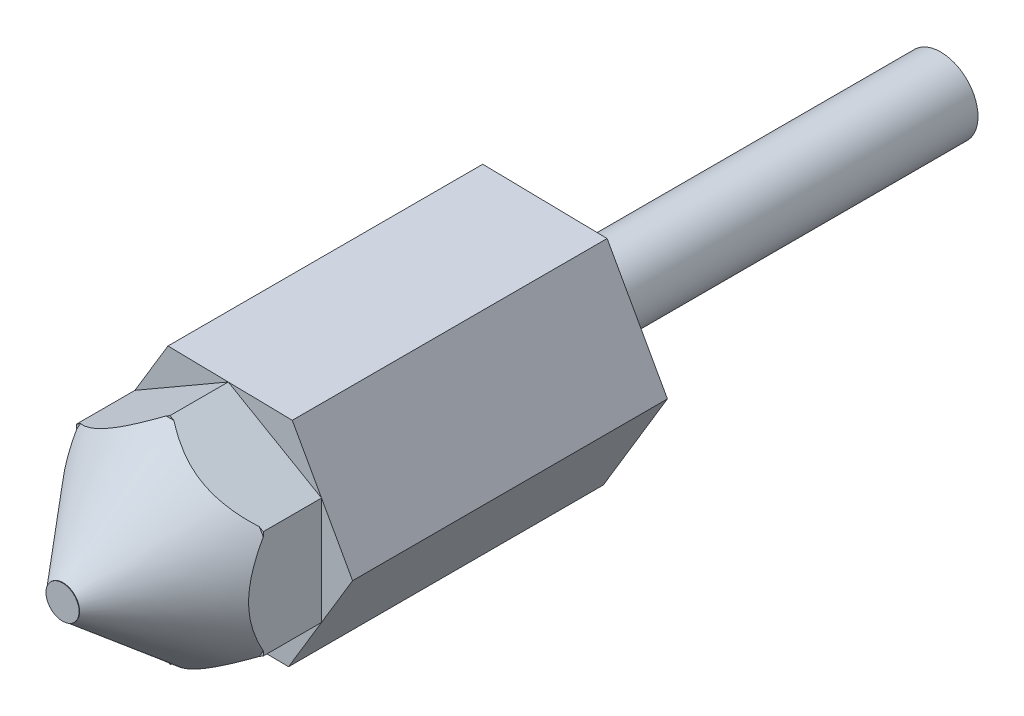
ISO-10303-21;
HEADER;
FILE_DESCRIPTION(('STEP AP214'),'2;1');
FILE_NAME('part.step','',(''),(''),'','','');
FILE_SCHEMA(('AUTOMOTIVE_DESIGN { 1 0 10303 214 1 1 1 1 }'));
ENDSEC;
DATA;
#1=APPLICATION_CONTEXT('core data for automotive mechanical design processes');
#2=APPLICATION_PROTOCOL_DEFINITION('international standard','automotive_design',2000,#1);
#3=PRODUCT_CONTEXT('',#1,'mechanical');
#4=PRODUCT('Part','Part','',(#3));
#5=PRODUCT_RELATED_PRODUCT_CATEGORY('part','',(#4));
#6=PRODUCT_DEFINITION_FORMATION('','',#4);
#7=PRODUCT_DEFINITION_CONTEXT('part definition',#1,'design');
#8=PRODUCT_DEFINITION('design','',#6,#7);
#9=PRODUCT_DEFINITION_SHAPE('','',#8);
#10=(LENGTH_UNIT() NAMED_UNIT(*) SI_UNIT(.MILLI.,.METRE.));
#11=(NAMED_UNIT(*) PLANE_ANGLE_UNIT() SI_UNIT($,.RADIAN.));
#12=(NAMED_UNIT(*) SI_UNIT($,.STERADIAN.) SOLID_ANGLE_UNIT());
#13=UNCERTAINTY_MEASURE_WITH_UNIT(LENGTH_MEASURE(1.E-05),#10,'distance_accuracy_value','');
#14=(GEOMETRIC_REPRESENTATION_CONTEXT(3) GLOBAL_UNCERTAINTY_ASSIGNED_CONTEXT((#13)) GLOBAL_UNIT_ASSIGNED_CONTEXT((#10,
#11,#12)) REPRESENTATION_CONTEXT('',''));
#15=CARTESIAN_POINT('',(0.,0.,0.));
#16=DIRECTION('',(0.,0.,1.));
#17=DIRECTION('',(1.,0.,0.));
#18=AXIS2_PLACEMENT_3D('',#15,#16,#17);
#19=CARTESIAN_POINT('',(5.63003281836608,3.25050096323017,10.));
#20=DIRECTION('',(-0.499999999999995,-0.866025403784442,0.));
#21=DIRECTION('',(0.866025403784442,-0.499999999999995,0.));
#22=AXIS2_PLACEMENT_3D('',#19,#20,#21);
#23=PLANE('',#22);
#24=DIRECTION('',(0.,0.,-1.));
#25=VECTOR('',#24,1.);
#26=CARTESIAN_POINT('',(0.,6.50100192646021,10.));
#27=LINE('',#26,#25);
#28=CARTESIAN_POINT('',(0.,6.50100192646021,3.5157355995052));
#29=VERTEX_POINT('',#28);
#30=CARTESIAN_POINT('',(0.,6.50100192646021,0.));
#31=VERTEX_POINT('',#30);
#32=EDGE_CURVE('E142',#29,#31,#27,.T.);
#33=ORIENTED_EDGE('',*,*,#32,.F.);
#34=DIRECTION('',(0.866025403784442,-0.499999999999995,0.));
#35=VECTOR('',#34,1.);
#36=CARTESIAN_POINT('',(5.63003281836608,3.25050096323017,3.5157355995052));
#37=LINE('',#36,#35);
#38=CARTESIAN_POINT('',(0.238864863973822,6.36309323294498,3.5157355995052));
#39=VERTEX_POINT('',#38);
#40=EDGE_CURVE('E255',#29,#39,#37,.T.);
#41=ORIENTED_EDGE('',*,*,#40,.T.);
#42=CARTESIAN_POINT('',(0.238556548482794,6.36327123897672,3.5155355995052));
#43=CARTESIAN_POINT('',(0.31511371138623,6.31907094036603,3.56519320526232));
#44=CARTESIAN_POINT('',(0.392304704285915,6.27450469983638,3.61354426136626));
#45=CARTESIAN_POINT('',(0.548064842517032,6.18457654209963,3.70728136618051));
#46=CARTESIAN_POINT('',(0.626634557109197,6.13921429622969,3.75266615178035));
#47=CARTESIAN_POINT('',(0.865216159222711,6.00146914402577,3.88418714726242));
#48=CARTESIAN_POINT('',(1.02739055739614,5.90783771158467,3.96522145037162));
#49=CARTESIAN_POINT('',(1.35585773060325,5.7181971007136,4.10922568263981));
#50=CARTESIAN_POINT('',(1.52209278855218,5.62222124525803,4.17236885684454));
#51=CARTESIAN_POINT('',(1.85927616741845,5.42754833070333,4.27752648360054));
#52=CARTESIAN_POINT('',(2.03021391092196,5.32885737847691,4.31958482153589));
#53=CARTESIAN_POINT('',(2.32313774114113,5.15973772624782,4.37027561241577));
#54=CARTESIAN_POINT('',(2.44432282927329,5.08977148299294,4.38516593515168));
#55=CARTESIAN_POINT('',(2.68740231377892,4.94942947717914,4.40238482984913));
#56=CARTESIAN_POINT('',(2.80929683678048,4.87905364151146,4.40471108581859));
#57=CARTESIAN_POINT('',(3.0528092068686,4.73846170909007,4.39666763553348));
#58=CARTESIAN_POINT('',(3.17442693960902,4.66824567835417,4.38629339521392));
#59=CARTESIAN_POINT('',(3.4163820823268,4.52855281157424,4.35335337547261));
#60=CARTESIAN_POINT('',(3.53671963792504,4.45907589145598,4.33078899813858));
#61=CARTESIAN_POINT('',(3.80861163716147,4.30209897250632,4.26661042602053));
#62=CARTESIAN_POINT('',(3.95953591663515,4.21496279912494,4.22144273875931));
#63=CARTESIAN_POINT('',(4.25724444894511,4.04308069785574,4.11546730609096));
#64=CARTESIAN_POINT('',(4.40402592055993,3.95833637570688,4.05464931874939));
#65=CARTESIAN_POINT('',(4.62112830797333,3.83299225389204,3.95366431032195));
#66=CARTESIAN_POINT('',(4.69315832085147,3.79140570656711,3.91827666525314));
#67=CARTESIAN_POINT('',(4.83605956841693,3.70890163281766,3.84460653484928));
#68=CARTESIAN_POINT('',(4.90693136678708,3.66798378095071,3.80632551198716));
#69=CARTESIAN_POINT('',(5.04734003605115,3.58691879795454,3.72729034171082));
#70=CARTESIAN_POINT('',(5.11688052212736,3.54676957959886,3.68654471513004));
#71=CARTESIAN_POINT('',(5.25492564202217,3.46706919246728,3.60272105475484));
#72=CARTESIAN_POINT('',(5.32342997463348,3.42751819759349,3.55964235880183));
#73=CARTESIAN_POINT('',(5.39142704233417,3.38826007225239,3.51553559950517));
#74=B_SPLINE_CURVE_WITH_KNOTS('',3,(#42,#43,#44,#45,#46,#47,#48,#49,#50,#51,#52,#53,#54,#55,#56,
#57,#58,#59,#60,#61,#62,#63,#64,#65,#66,#67,#68,#69,#70,#71,#72,#73),.UNSPECIFIED.,.F.,.F.,(4,2,
2,2,2,2,2,2,2,2,2,2,2,2,2,4),(0.,0.30415764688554,0.608443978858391,1.21984322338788,
1.82510226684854,2.42909625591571,2.85074868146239,3.27247882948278,3.69435957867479,
4.11619181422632,4.6553913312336,5.19494461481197,5.46606472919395,5.73704870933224,
6.00714414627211,6.27731664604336),.UNSPECIFIED.);
#75=CARTESIAN_POINT('',(5.39111872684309,3.38843807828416,3.5157355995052));
#76=VERTEX_POINT('',#75);
#77=EDGE_CURVE('E275',#39,#76,#74,.T.);
#78=ORIENTED_EDGE('',*,*,#77,.T.);
#79=CARTESIAN_POINT('',(5.63003281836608,3.25050096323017,3.5157355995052));
#80=VERTEX_POINT('',#79);
#81=EDGE_CURVE('E145',#76,#80,#37,.T.);
#82=ORIENTED_EDGE('',*,*,#81,.T.);
#83=DIRECTION('',(0.,0.,-1.));
#84=VECTOR('',#83,1.);
#85=CARTESIAN_POINT('',(5.63003281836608,3.25050096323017,10.));
#86=LINE('',#85,#84);
#87=CARTESIAN_POINT('',(5.63003281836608,3.25050096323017,0.));
#88=VERTEX_POINT('',#87);
#89=EDGE_CURVE('E67',#80,#88,#86,.T.);
#90=ORIENTED_EDGE('',*,*,#89,.T.);
#91=DIRECTION('',(-0.866025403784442,0.499999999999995,0.));
#92=VECTOR('',#91,1.);
#93=CARTESIAN_POINT('',(5.63003281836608,3.25050096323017,0.));
#94=LINE('',#93,#92);
#95=EDGE_CURVE('E253',#88,#31,#94,.T.);
#96=ORIENTED_EDGE('',*,*,#95,.T.);
#97=EDGE_LOOP('',(#33,#41,#78,#82,#90,#96));
#98=FACE_BOUND('',#97,.T.);
#99=ADVANCED_FACE('F44',(#98),#23,.F.);
#100=CARTESIAN_POINT('',(0.,6.50100192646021,10.));
#101=DIRECTION('',(0.500000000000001,-0.866025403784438,0.));
#102=DIRECTION('',(0.866025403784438,0.500000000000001,0.));
#103=AXIS2_PLACEMENT_3D('',#100,#101,#102);
#104=PLANE('',#103);
#105=DIRECTION('',(0.,0.,-1.));
#106=VECTOR('',#105,1.);
#107=CARTESIAN_POINT('',(-5.63003281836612,3.25050096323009,10.));
#108=LINE('',#107,#106);
#109=CARTESIAN_POINT('',(-5.63003281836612,3.25050096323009,3.5157355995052));
#110=VERTEX_POINT('',#109);
#111=CARTESIAN_POINT('',(-5.63003281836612,3.25050096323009,0.));
#112=VERTEX_POINT('',#111);
#113=EDGE_CURVE('E164',#110,#112,#108,.T.);
#114=ORIENTED_EDGE('',*,*,#113,.F.);
#115=DIRECTION('',(0.866025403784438,0.500000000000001,0.));
#116=VECTOR('',#115,1.);
#117=CARTESIAN_POINT('',(0.,6.50100192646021,3.5157355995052));
#118=LINE('',#117,#116);
#119=CARTESIAN_POINT('',(-5.39117023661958,3.38840833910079,3.5157355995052));
#120=VERTEX_POINT('',#119);
#121=EDGE_CURVE('E230',#110,#120,#118,.T.);
#122=ORIENTED_EDGE('',*,*,#121,.T.);
#123=CARTESIAN_POINT('',(-5.39147854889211,3.38823033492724,3.51553559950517));
#124=CARTESIAN_POINT('',(-5.31492075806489,3.4324309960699,3.56519413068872));
#125=CARTESIAN_POINT('',(-5.23772912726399,3.47699760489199,3.61354610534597));
#126=CARTESIAN_POINT('',(-5.08196768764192,3.56692651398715,3.70728502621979));
#127=CARTESIAN_POINT('',(-5.00339730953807,3.61228914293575,3.75267070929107));
#128=CARTESIAN_POINT('',(-4.76481363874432,3.75003548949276,3.88419437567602));
#129=CARTESIAN_POINT('',(-4.60263778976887,3.8436677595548,3.96523040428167));
#130=CARTESIAN_POINT('',(-4.27416761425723,4.03331010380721,4.10923781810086));
#131=CARTESIAN_POINT('',(-4.10793100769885,4.12928685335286,4.17238245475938));
#132=CARTESIAN_POINT('',(-3.77074438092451,4.32396164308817,4.27754262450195));
#133=CARTESIAN_POINT('',(-3.59980493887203,4.42265357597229,4.31960204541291));
#134=CARTESIAN_POINT('',(-3.30687967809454,4.59177405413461,4.37029395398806));
#135=CARTESIAN_POINT('',(-3.18569490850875,4.66174011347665,4.38518460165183));
#136=CARTESIAN_POINT('',(-2.94261603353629,4.80208176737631,4.40240418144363));
#137=CARTESIAN_POINT('',(-2.82072180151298,4.87245743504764,4.40473079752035));
#138=CARTESIAN_POINT('',(-2.57720998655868,5.01304904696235,4.39668808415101));
#139=CARTESIAN_POINT('',(-2.45559251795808,5.08326492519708,4.38631422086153));
#140=CARTESIAN_POINT('',(-2.213637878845,5.22295750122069,4.35337495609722));
#141=CARTESIAN_POINT('',(-2.09330056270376,5.29243428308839,4.33081095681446));
#142=CARTESIAN_POINT('',(-1.82140518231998,5.44941315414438,4.26663230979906));
#143=CARTESIAN_POINT('',(-1.67047735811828,5.53655137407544,4.22146369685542));
#144=CARTESIAN_POINT('',(-1.3727619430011,5.70843744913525,4.11548565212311));
#145=CARTESIAN_POINT('',(-1.22597713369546,5.7931836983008,4.05466597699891));
#146=CARTESIAN_POINT('',(-1.00886985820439,5.9185306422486,3.9536780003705));
#147=CARTESIAN_POINT('',(-0.936838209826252,5.96011813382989,3.91828927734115));
#148=CARTESIAN_POINT('',(-0.793933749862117,6.04262406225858,3.84461687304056));
#149=CARTESIAN_POINT('',(-0.723060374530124,6.08354282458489,3.80633465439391));
#150=CARTESIAN_POINT('',(-0.582648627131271,6.164609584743,3.72729700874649));
#151=CARTESIAN_POINT('',(-0.513106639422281,6.20475967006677,3.68655010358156));
#152=CARTESIAN_POINT('',(-0.37505856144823,6.2844617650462,3.60272380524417));
#153=CARTESIAN_POINT('',(-0.306552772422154,6.32401360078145,3.55964374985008));
#154=CARTESIAN_POINT('',(-0.238554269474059,6.36327255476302,3.5155355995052));
#155=B_SPLINE_CURVE_WITH_KNOTS('',3,(#123,#124,#125,#126,#127,#128,#129,#130,#131,#132,#133,
#134,#135,#136,#137,#138,#139,#140,#141,#142,#143,#144,#145,#146,#147,#148,#149,#150,#151,#152,
#153,#154),.UNSPECIFIED.,.F.,.F.,(4,2,2,2,2,2,2,2,2,2,2,2,2,2,2,4),(0.,0.304160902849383,
0.608450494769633,1.21985639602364,1.82512188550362,2.42912225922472,2.8507736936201,
3.27250285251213,3.69438260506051,4.11621384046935,4.65542586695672,5.19499169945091,
5.46611829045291,5.73710873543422,6.00721054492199,6.27738942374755),.UNSPECIFIED.);
#156=CARTESIAN_POINT('',(-0.238862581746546,6.36309455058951,3.5157355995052));
#157=VERTEX_POINT('',#156);
#158=EDGE_CURVE('E210',#120,#157,#155,.T.);
#159=ORIENTED_EDGE('',*,*,#158,.T.);
#160=EDGE_CURVE('E246',#157,#29,#118,.T.);
#161=ORIENTED_EDGE('',*,*,#160,.T.);
#162=ORIENTED_EDGE('',*,*,#32,.T.);
#163=DIRECTION('',(-0.866025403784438,-0.500000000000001,0.));
#164=VECTOR('',#163,1.);
#165=CARTESIAN_POINT('',(0.,6.50100192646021,0.));
#166=LINE('',#165,#164);
#167=EDGE_CURVE('E232',#31,#112,#166,.T.);
#168=ORIENTED_EDGE('',*,*,#167,.T.);
#169=EDGE_LOOP('',(#114,#122,#159,#161,#162,#168));
#170=FACE_BOUND('',#169,.T.);
#171=ADVANCED_FACE('F218',(#170),#104,.F.);
#172=CARTESIAN_POINT('',(-5.63003281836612,3.25050096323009,10.));
#173=DIRECTION('',(1.,0.,0.));
#174=DIRECTION('',(0.,1.,0.));
#175=AXIS2_PLACEMENT_3D('',#172,#173,#174);
#176=PLANE('',#175);
#177=DIRECTION('',(0.,0.,-1.));
#178=VECTOR('',#177,1.);
#179=CARTESIAN_POINT('',(-5.6300328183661,-3.25050096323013,10.));
#180=LINE('',#179,#178);
#181=CARTESIAN_POINT('',(-5.6300328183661,-3.25050096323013,3.5157355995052));
#182=VERTEX_POINT('',#181);
#183=CARTESIAN_POINT('',(-5.6300328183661,-3.25050096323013,0.));
#184=VERTEX_POINT('',#183);
#185=EDGE_CURVE('E162',#182,#184,#180,.T.);
#186=ORIENTED_EDGE('',*,*,#185,.F.);
#187=DIRECTION('',(0.,1.,0.));
#188=VECTOR('',#187,1.);
#189=CARTESIAN_POINT('',(-5.63003281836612,3.25050096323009,3.5157355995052));
#190=LINE('',#189,#188);
#191=CARTESIAN_POINT('',(-5.6300328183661,-2.97462673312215,3.5157355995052));
#192=VERTEX_POINT('',#191);
#193=EDGE_CURVE('E244',#182,#192,#190,.T.);
#194=ORIENTED_EDGE('',*,*,#193,.T.);
#195=CARTESIAN_POINT('',(-5.63003281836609,-5.87576129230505,1.38716200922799));
#196=CARTESIAN_POINT('',(-5.63003281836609,-5.74069500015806,1.50440823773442));
#197=CARTESIAN_POINT('',(-5.63003281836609,-5.60468641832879,1.62058619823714));
#198=CARTESIAN_POINT('',(-5.63003281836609,-5.33043886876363,1.85035197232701));
#199=CARTESIAN_POINT('',(-5.63003281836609,-5.19219931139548,1.9639390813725));
#200=CARTESIAN_POINT('',(-5.63003281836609,-4.91207787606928,2.18892030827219));
#201=CARTESIAN_POINT('',(-5.63003281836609,-4.77017548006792,2.3002889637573));
#202=CARTESIAN_POINT('',(-5.63003281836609,-4.48345521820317,2.51919574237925));
#203=CARTESIAN_POINT('',(-5.63003281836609,-4.33863757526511,2.62673415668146));
#204=CARTESIAN_POINT('',(-5.6300328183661,-4.03747668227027,2.84301748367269));
#205=CARTESIAN_POINT('',(-5.6300328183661,-3.88094090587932,2.95149559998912));
#206=CARTESIAN_POINT('',(-5.6300328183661,-3.56352703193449,3.16199968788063));
#207=CARTESIAN_POINT('',(-5.6300328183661,-3.40264822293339,3.26402459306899));
#208=CARTESIAN_POINT('',(-5.6300328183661,-3.07650861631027,3.4596092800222));
#209=CARTESIAN_POINT('',(-5.6300328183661,-2.91126392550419,3.55319573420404));
#210=CARTESIAN_POINT('',(-5.6300328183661,-2.57540191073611,3.73010310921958));
#211=CARTESIAN_POINT('',(-5.6300328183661,-2.40478711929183,3.81342878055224));
#212=CARTESIAN_POINT('',(-5.6300328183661,-2.08741309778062,3.95403770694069));
#213=CARTESIAN_POINT('',(-5.6300328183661,-1.94155307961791,4.01333842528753));
#214=CARTESIAN_POINT('',(-5.6300328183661,-1.64586823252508,4.12127253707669));
#215=CARTESIAN_POINT('',(-5.6300328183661,-1.49604284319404,4.16990441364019));
#216=CARTESIAN_POINT('',(-5.63003281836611,-1.1947947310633,4.25404036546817));
#217=CARTESIAN_POINT('',(-5.63003281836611,-1.04341773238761,4.28970610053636));
#218=CARTESIAN_POINT('',(-5.63003281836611,-0.738051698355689,4.34708465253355));
#219=CARTESIAN_POINT('',(-5.63003281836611,-0.584063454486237,4.36880162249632));
#220=CARTESIAN_POINT('',(-5.63003281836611,-0.266815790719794,4.39780694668));
#221=CARTESIAN_POINT('',(-5.63003281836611,-0.103482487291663,4.40430705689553));
#222=CARTESIAN_POINT('',(-5.63003281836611,0.222957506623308,4.40014572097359));
#223=CARTESIAN_POINT('',(-5.63003281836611,0.386064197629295,4.38948431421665));
#224=CARTESIAN_POINT('',(-5.63003281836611,0.711024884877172,4.35162039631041));
#225=CARTESIAN_POINT('',(-5.63003281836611,0.87287048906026,4.32434701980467));
#226=CARTESIAN_POINT('',(-5.63003281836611,1.19329360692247,4.25481624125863));
#227=CARTESIAN_POINT('',(-5.63003281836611,1.35187023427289,4.21255483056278));
#228=CARTESIAN_POINT('',(-5.63003281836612,1.71388431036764,4.09990044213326));
#229=CARTESIAN_POINT('',(-5.63003281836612,1.91586180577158,4.02484366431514));
#230=CARTESIAN_POINT('',(-5.63003281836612,2.3123730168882,3.85724745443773));
#231=CARTESIAN_POINT('',(-5.63003281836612,2.50690300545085,3.76469940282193));
#232=CARTESIAN_POINT('',(-5.63003281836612,2.8909443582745,3.56513557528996));
#233=CARTESIAN_POINT('',(-5.63003281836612,3.08038073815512,3.45797693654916));
#234=CARTESIAN_POINT('',(-5.63003281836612,3.35969529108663,3.28941248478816));
#235=CARTESIAN_POINT('',(-5.63003281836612,3.45198181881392,3.23192788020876));
#236=CARTESIAN_POINT('',(-5.63003281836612,3.63507478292,3.11465132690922));
#237=CARTESIAN_POINT('',(-5.63003281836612,3.72588126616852,3.05485945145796));
#238=CARTESIAN_POINT('',(-5.63003281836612,4.00626211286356,2.86570187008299));
#239=CARTESIAN_POINT('',(-5.63003281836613,4.19348262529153,2.73284238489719));
#240=CARTESIAN_POINT('',(-5.63003281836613,4.56282961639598,2.46019614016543));
#241=CARTESIAN_POINT('',(-5.63003281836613,4.74495491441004,2.32040779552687));
#242=CARTESIAN_POINT('',(-5.63003281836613,5.10506237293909,2.03530270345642));
#243=CARTESIAN_POINT('',(-5.63003281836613,5.28304089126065,1.8899813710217));
#244=CARTESIAN_POINT('',(-5.63003281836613,5.63537081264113,1.59504829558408));
#245=CARTESIAN_POINT('',(-5.63003281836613,5.80972248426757,1.44543687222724));
#246=CARTESIAN_POINT('',(-5.63003281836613,6.15605195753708,1.14215814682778));
#247=CARTESIAN_POINT('',(-5.63003281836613,6.32801792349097,0.988477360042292));
#248=CARTESIAN_POINT('',(-5.63003281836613,6.66934990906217,0.678251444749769));
#249=CARTESIAN_POINT('',(-5.63003281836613,6.83871584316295,0.52170622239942));
#250=CARTESIAN_POINT('',(-5.63003281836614,7.34353472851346,0.0485165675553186));
#251=CARTESIAN_POINT('',(-5.63003281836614,7.67568162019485,-0.271657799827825));
#252=CARTESIAN_POINT('',(-5.63003281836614,8.15258137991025,-0.740739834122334));
#253=CARTESIAN_POINT('',(-5.63003281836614,8.29994959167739,-0.887014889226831));
#254=CARTESIAN_POINT('',(-5.63003281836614,8.59349852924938,-1.18073468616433));
#255=CARTESIAN_POINT('',(-5.63003281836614,8.73967933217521,-1.32817935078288));
#256=CARTESIAN_POINT('',(-5.63003281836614,9.17671009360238,-1.77208961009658));
#257=CARTESIAN_POINT('',(-5.63003281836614,9.46600369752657,-2.07008731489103));
#258=CARTESIAN_POINT('',(-5.63003281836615,10.0387509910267,-2.66656675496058));
#259=CARTESIAN_POINT('',(-5.63003281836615,10.3222337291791,-2.96502067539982));
#260=CARTESIAN_POINT('',(-5.63003281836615,10.8865053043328,-3.56435498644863));
#261=CARTESIAN_POINT('',(-5.63003281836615,11.1672946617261,-3.8652348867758));
#262=CARTESIAN_POINT('',(-5.63003281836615,11.4470594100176,-4.16705530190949));
#263=B_SPLINE_CURVE_WITH_KNOTS('',3,(#195,#196,#197,#198,#199,#200,#201,#202,#203,#204,#205,
#206,#207,#208,#209,#210,#211,#212,#213,#214,#215,#216,#217,#218,#219,#220,#221,#222,#223,#224,
#225,#226,#227,#228,#229,#230,#231,#232,#233,#234,#235,#236,#237,#238,#239,#240,#241,#242,#243,
#244,#245,#246,#247,#248,#249,#250,#251,#252,#253,#254,#255,#256,#257,#258,#259,#260,#261,#262),
.UNSPECIFIED.,.F.,.F.,(4,2,2,2,2,2,2,2,2,2,2,2,2,2,2,2,2,2,2,2,2,2,2,2,2,2,2,2,2,2,2,2,2,4),(0.,
0.53658006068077,1.07330433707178,1.6144088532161,2.15547214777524,2.72669081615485,
3.29800363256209,3.86744221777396,4.43661616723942,4.90863379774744,5.38071849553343,
5.84669723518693,6.31253717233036,6.80202012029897,7.2915019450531,7.78308662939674,
8.2748028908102,8.92011666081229,9.56574926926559,10.2182206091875,10.5443717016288,
10.8705124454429,11.5589975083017,12.2476408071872,12.9368677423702,13.6260434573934,
14.3178932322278,15.0097657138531,16.3936194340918,17.0165330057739,17.6394057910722,
18.8853398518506,20.1202060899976,21.3548287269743),.UNSPECIFIED.);
#264=CARTESIAN_POINT('',(-5.63003281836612,2.97468357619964,3.5157355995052));
#265=VERTEX_POINT('',#264);
#266=EDGE_CURVE('E204',#192,#265,#263,.T.);
#267=ORIENTED_EDGE('',*,*,#266,.T.);
#268=EDGE_CURVE('E239',#265,#110,#190,.T.);
#269=ORIENTED_EDGE('',*,*,#268,.T.);
#270=ORIENTED_EDGE('',*,*,#113,.T.);
#271=DIRECTION('',(0.,-1.,0.));
#272=VECTOR('',#271,1.);
#273=CARTESIAN_POINT('',(-5.63003281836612,3.25050096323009,0.));
#274=LINE('',#273,#272);
#275=EDGE_CURVE('E237',#112,#184,#274,.T.);
#276=ORIENTED_EDGE('',*,*,#275,.T.);
#277=EDGE_LOOP('',(#186,#194,#267,#269,#270,#276));
#278=FACE_BOUND('',#277,.T.);
#279=ADVANCED_FACE('F215',(#278),#176,.F.);
#280=CARTESIAN_POINT('',(-5.6300328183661,-3.25050096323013,10.));
#281=DIRECTION('',(0.499999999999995,0.866025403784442,0.));
#282=DIRECTION('',(-0.866025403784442,0.499999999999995,0.));
#283=AXIS2_PLACEMENT_3D('',#280,#281,#282);
#284=PLANE('',#283);
#285=DIRECTION('',(0.,0.,-1.));
#286=VECTOR('',#285,1.);
#287=CARTESIAN_POINT('',(0.,-6.50100192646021,10.));
#288=LINE('',#287,#286);
#289=CARTESIAN_POINT('',(0.,-6.50100192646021,3.5157355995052));
#290=VERTEX_POINT('',#289);
#291=CARTESIAN_POINT('',(0.,-6.50100192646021,0.));
#292=VERTEX_POINT('',#291);
#293=EDGE_CURVE('E155',#290,#292,#288,.T.);
#294=ORIENTED_EDGE('',*,*,#293,.F.);
#295=DIRECTION('',(-0.866025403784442,0.499999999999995,0.));
#296=VECTOR('',#295,1.);
#297=CARTESIAN_POINT('',(-5.6300328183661,-3.25050096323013,3.5157355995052));
#298=LINE('',#297,#296);
#299=CARTESIAN_POINT('',(-0.238967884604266,-6.36303375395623,3.5157355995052));
#300=VERTEX_POINT('',#299);
#301=EDGE_CURVE('E250',#290,#300,#298,.T.);
#302=ORIENTED_EDGE('',*,*,#301,.T.);
#303=CARTESIAN_POINT('',(-0.238659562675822,-6.36321176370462,3.5155355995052));
#304=CARTESIAN_POINT('',(-0.315215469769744,-6.31901219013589,3.56519135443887));
#305=CARTESIAN_POINT('',(-0.392405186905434,-6.27444668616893,3.61354057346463));
#306=CARTESIAN_POINT('',(-0.54816272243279,-6.18452003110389,3.70727404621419));
#307=CARTESIAN_POINT('',(-0.626731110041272,-6.13915855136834,3.75265703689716));
#308=CARTESIAN_POINT('',(-0.865308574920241,-6.00141578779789,3.8841726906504));
#309=CARTESIAN_POINT('',(-1.02748007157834,-5.90778603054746,3.96520354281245));
#310=CARTESIAN_POINT('',(-1.35594124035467,-5.7181488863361,4.10920141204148));
#311=CARTESIAN_POINT('',(-1.52217320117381,-5.62217481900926,4.17234166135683));
#312=CARTESIAN_POINT('',(-1.85935008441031,-5.42750565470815,4.27749420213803));
#313=CARTESIAN_POINT('',(-2.03028443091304,-5.32881666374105,4.31955037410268));
#314=CARTESIAN_POINT('',(-2.32320540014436,-5.15969866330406,4.37023892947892));
#315=CARTESIAN_POINT('',(-2.44439112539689,-5.08973205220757,4.38512860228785));
#316=CARTESIAN_POINT('',(-2.68747182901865,-4.94938934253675,4.40234612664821));
#317=CARTESIAN_POINT('',(-2.80936693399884,-4.87901317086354,4.40467166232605));
#318=CARTESIAN_POINT('',(-3.05288041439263,-4.73842059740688,4.39662673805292));
#319=CARTESIAN_POINT('',(-3.17449867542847,-4.66820426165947,4.3862517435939));
#320=CARTESIAN_POINT('',(-3.41645482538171,-4.52851081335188,4.35331021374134));
#321=CARTESIAN_POINT('',(-3.53679285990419,-4.45903361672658,4.33074508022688));
#322=CARTESIAN_POINT('',(-3.80867809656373,-4.30206060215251,4.26656665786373));
#323=CARTESIAN_POINT('',(-3.95959528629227,-4.2149285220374,4.22140082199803));
#324=CARTESIAN_POINT('',(-4.25729005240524,-4.04305436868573,4.11543061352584));
#325=CARTESIAN_POINT('',(-4.40406484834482,-3.95831390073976,4.05461600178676));
#326=CARTESIAN_POINT('',(-4.62115745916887,-3.83297542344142,3.9536369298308));
#327=CARTESIAN_POINT('',(-4.69318420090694,-3.7913907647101,3.91825144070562));
#328=CARTESIAN_POINT('',(-4.83607902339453,-3.70889040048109,3.84458585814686));
#329=CARTESIAN_POINT('',(-4.90694766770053,-3.66797436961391,3.80630722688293));
#330=CARTESIAN_POINT('',(-5.04735018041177,-3.58691294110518,3.72727700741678));
#331=CARTESIAN_POINT('',(-5.11688766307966,-3.5467654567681,3.68653393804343));
#332=CARTESIAN_POINT('',(-5.25492686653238,-3.46706848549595,3.6027155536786));
#333=CARTESIAN_POINT('',(-5.32342828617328,-3.42751917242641,3.55963957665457));
#334=CARTESIAN_POINT('',(-5.39142248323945,-3.38826270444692,3.51553559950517));
#335=B_SPLINE_CURVE_WITH_KNOTS('',3,(#303,#304,#305,#306,#307,#308,#309,#310,#311,#312,#313,
#314,#315,#316,#317,#318,#319,#320,#321,#322,#323,#324,#325,#326,#327,#328,#329,#330,#331,#332,
#333,#334),.UNSPECIFIED.,.F.,.F.,(4,2,2,2,2,2,2,2,2,2,2,2,2,2,2,4),(0.,0.304151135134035,
0.608430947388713,1.21981687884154,1.82506303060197,2.42904425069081,2.85069865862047,
3.27243078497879,3.69431352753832,4.1161477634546,4.65532226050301,5.19485044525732,
5.46595760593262,5.73692865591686,6.00701134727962,6.27717108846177),.UNSPECIFIED.);
#336=CARTESIAN_POINT('',(-5.39111416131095,-3.38844071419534,3.5157355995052));
#337=VERTEX_POINT('',#336);
#338=EDGE_CURVE('E197',#300,#337,#335,.T.);
#339=ORIENTED_EDGE('',*,*,#338,.T.);
#340=EDGE_CURVE('E248',#337,#182,#298,.T.);
#341=ORIENTED_EDGE('',*,*,#340,.T.);
#342=ORIENTED_EDGE('',*,*,#185,.T.);
#343=DIRECTION('',(0.866025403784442,-0.499999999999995,0.));
#344=VECTOR('',#343,1.);
#345=CARTESIAN_POINT('',(-5.6300328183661,-3.25050096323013,0.));
#346=LINE('',#345,#344);
#347=EDGE_CURVE('E258',#184,#292,#346,.T.);
#348=ORIENTED_EDGE('',*,*,#347,.T.);
#349=EDGE_LOOP('',(#294,#302,#339,#341,#342,#348));
#350=FACE_BOUND('',#349,.T.);
#351=ADVANCED_FACE('F187',(#350),#284,.F.);
#352=CARTESIAN_POINT('',(0.,-6.50100192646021,10.));
#353=DIRECTION('',(-0.500000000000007,0.866025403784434,0.));
#354=DIRECTION('',(-0.866025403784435,-0.500000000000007,0.));
#355=AXIS2_PLACEMENT_3D('',#352,#353,#354);
#356=PLANE('',#355);
#357=DIRECTION('',(0.,0.,-1.));
#358=VECTOR('',#357,1.);
#359=CARTESIAN_POINT('',(5.63003281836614,-3.25050096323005,10.));
#360=LINE('',#359,#358);
#361=CARTESIAN_POINT('',(5.63003281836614,-3.25050096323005,3.5157355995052));
#362=VERTEX_POINT('',#361);
#363=CARTESIAN_POINT('',(5.63003281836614,-3.25050096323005,0.));
#364=VERTEX_POINT('',#363);
#365=EDGE_CURVE('E153',#362,#364,#360,.T.);
#366=ORIENTED_EDGE('',*,*,#365,.F.);
#367=DIRECTION('',(-0.866025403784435,-0.500000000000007,0.));
#368=VECTOR('',#367,1.);
#369=CARTESIAN_POINT('',(0.,-6.50100192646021,3.5157355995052));
#370=LINE('',#369,#368);
#371=CARTESIAN_POINT('',(5.39106265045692,-3.38847045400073,3.5157355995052));
#372=VERTEX_POINT('',#371);
#373=EDGE_CURVE('E274',#362,#372,#370,.T.);
#374=ORIENTED_EDGE('',*,*,#373,.T.);
#375=CARTESIAN_POINT('',(5.39137097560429,-3.3882924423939,3.51553559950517));
#376=CARTESIAN_POINT('',(5.3148156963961,-3.43249165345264,3.56519042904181));
#377=CARTESIAN_POINT('',(5.23762661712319,-3.47705678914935,3.6135387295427));
#378=CARTESIAN_POINT('',(5.08187038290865,-3.56698269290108,3.70727038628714));
#379=CARTESIAN_POINT('',(5.00330265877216,-3.6123437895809,3.75265247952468));
#380=CARTESIAN_POINT('',(4.76472726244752,-3.75008535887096,3.88416546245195));
#381=CARTESIAN_POINT('',(4.60255721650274,-3.84371427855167,3.96519458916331));
#382=CARTESIAN_POINT('',(4.27409904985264,-4.03334968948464,4.10918927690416));
#383=CARTESIAN_POINT('',(4.10786863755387,-4.12932286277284,4.17232806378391));
#384=CARTESIAN_POINT('',(3.77069500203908,-4.32399015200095,4.27747806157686));
#385=CARTESIAN_POINT('',(3.59976235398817,-4.42267816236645,4.31953315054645));
#386=CARTESIAN_POINT('',(3.30684281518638,-4.59179533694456,4.3702205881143));
#387=CARTESIAN_POINT('',(3.18565677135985,-4.66176213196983,4.3851099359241));
#388=CARTESIAN_POINT('',(2.94257545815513,-4.80210519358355,4.40232677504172));
#389=CARTESIAN_POINT('',(2.82068006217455,-4.87248153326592,4.40465195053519));
#390=CARTESIAN_POINT('',(2.57716602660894,-5.01307442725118,4.39660628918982));
#391=CARTESIAN_POINT('',(2.45554750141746,-5.08329091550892,4.3862309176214));
#392=CARTESIAN_POINT('',(2.21359084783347,-5.22298465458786,4.35328863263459));
#393=CARTESIAN_POINT('',(2.09325257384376,-5.29246198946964,4.33072312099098));
#394=CARTESIAN_POINT('',(1.82137071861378,-5.44943305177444,4.26654477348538));
#395=CARTESIAN_POINT('',(1.67045707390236,-5.53656308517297,4.22137986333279));
#396=CARTESIAN_POINT('',(1.37276919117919,-5.70843326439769,4.11541226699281));
#397=CARTESIAN_POINT('',(1.22599773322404,-5.79317180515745,4.05459934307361));
#398=CARTESIAN_POINT('',(1.00891001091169,-5.91850746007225,3.95362323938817));
#399=CARTESIAN_POINT('',(0.936884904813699,-5.96009117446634,3.91823882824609));
#400=CARTESIAN_POINT('',(0.79399329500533,-6.04258968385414,3.8445755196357));
#401=CARTESIAN_POINT('',(0.723126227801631,-6.08350480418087,3.80629808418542));
#402=CARTESIAN_POINT('',(0.582726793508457,-6.16456445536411,3.72727034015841));
#403=CARTESIAN_POINT('',(0.5131908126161,-6.20471107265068,3.68652854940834));
#404=CARTESIAN_POINT('',(0.375154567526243,-6.28440633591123,3.60271280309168));
#405=CARTESIAN_POINT('',(0.306654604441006,-6.32395480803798,3.55963818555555));
#406=CARTESIAN_POINT('',(0.238661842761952,-6.36321044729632,3.5155355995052));
#407=B_SPLINE_CURVE_WITH_KNOTS('',3,(#375,#376,#377,#378,#379,#380,#381,#382,#383,#384,#385,
#386,#387,#388,#389,#390,#391,#392,#393,#394,#395,#396,#397,#398,#399,#400,#401,#402,#403,#404,
#405,#406),.UNSPECIFIED.,.F.,.F.,(4,2,2,2,2,2,2,2,2,2,2,2,2,2,2,4),(0.,0.304147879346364,
0.608424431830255,1.2198037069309,1.82504341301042,2.42901824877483,2.85067364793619,
3.27240676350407,3.6942905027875,4.11612573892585,4.65528772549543,5.19480336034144,
5.46590404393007,5.73686862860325,6.00694494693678,6.27709830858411),.UNSPECIFIED.);
#408=CARTESIAN_POINT('',(0.23897016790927,-6.36303243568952,3.5157355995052));
#409=VERTEX_POINT('',#408);
#410=EDGE_CURVE('E168',#372,#409,#407,.T.);
#411=ORIENTED_EDGE('',*,*,#410,.T.);
#412=EDGE_CURVE('E273',#409,#290,#370,.T.);
#413=ORIENTED_EDGE('',*,*,#412,.T.);
#414=ORIENTED_EDGE('',*,*,#293,.T.);
#415=DIRECTION('',(0.866025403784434,0.500000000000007,0.));
#416=VECTOR('',#415,1.);
#417=CARTESIAN_POINT('',(0.,-6.50100192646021,0.));
#418=LINE('',#417,#416);
#419=EDGE_CURVE('E157',#292,#364,#418,.T.);
#420=ORIENTED_EDGE('',*,*,#419,.T.);
#421=EDGE_LOOP('',(#366,#374,#411,#413,#414,#420));
#422=FACE_BOUND('',#421,.T.);
#423=ADVANCED_FACE('F182',(#422),#356,.F.);
#424=CARTESIAN_POINT('',(5.63003281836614,-3.25050096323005,10.));
#425=DIRECTION('',(-1.,0.,0.));
#426=DIRECTION('',(0.,-1.,0.));
#427=AXIS2_PLACEMENT_3D('',#424,#425,#426);
#428=PLANE('',#427);
#429=ORIENTED_EDGE('',*,*,#89,.F.);
#430=DIRECTION('',(0.,-1.,0.));
#431=VECTOR('',#430,1.);
#432=CARTESIAN_POINT('',(5.63003281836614,-3.25050096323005,3.5157355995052));
#433=LINE('',#432,#431);
#434=CARTESIAN_POINT('',(5.63003281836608,2.97462146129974,3.5157355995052));
#435=VERTEX_POINT('',#434);
#436=EDGE_CURVE('E12',#80,#435,#433,.T.);
#437=ORIENTED_EDGE('',*,*,#436,.T.);
#438=CARTESIAN_POINT('',(5.63003281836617,-5.87572344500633,1.38716756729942));
#439=CARTESIAN_POINT('',(5.63003281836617,-5.74065796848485,1.50441239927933));
#440=CARTESIAN_POINT('',(5.63003281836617,-5.6046502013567,1.62058895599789));
#441=CARTESIAN_POINT('',(5.63003281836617,-5.3304042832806,1.85035190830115));
#442=CARTESIAN_POINT('',(5.63003281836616,-5.19216554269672,1.96393759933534));
#443=CARTESIAN_POINT('',(5.63003281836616,-4.91204576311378,2.18891595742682));
#444=CARTESIAN_POINT('',(5.63003281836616,-4.77014420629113,2.30028316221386));
#445=CARTESIAN_POINT('',(5.63003281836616,-4.48342563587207,2.51918702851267));
#446=CARTESIAN_POINT('',(5.63003281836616,-4.33860884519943,2.6267239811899));
#447=CARTESIAN_POINT('',(5.63003281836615,-4.0374498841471,2.84300418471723));
#448=CARTESIAN_POINT('',(5.63003281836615,-3.88091519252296,2.95148064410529));
#449=CARTESIAN_POINT('',(5.63003281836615,-3.56350353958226,3.16198143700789));
#450=CARTESIAN_POINT('',(5.63003281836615,-3.40262586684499,3.2640047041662));
#451=CARTESIAN_POINT('',(5.63003281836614,-3.07648859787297,3.45958617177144));
#452=CARTESIAN_POINT('',(5.63003281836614,-2.91124510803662,3.55317104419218));
#453=CARTESIAN_POINT('',(5.63003281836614,-2.57538559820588,3.73007535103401));
#454=CARTESIAN_POINT('',(5.63003281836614,-2.40477211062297,3.81339953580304));
#455=CARTESIAN_POINT('',(5.63003281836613,-2.08739858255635,3.954006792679));
#456=CARTESIAN_POINT('',(5.63003281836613,-1.94153767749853,4.01330717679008));
#457=CARTESIAN_POINT('',(5.63003281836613,-1.64585105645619,4.12124047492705));
#458=CARTESIAN_POINT('',(5.63003281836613,-1.49602478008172,4.16987187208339));
#459=CARTESIAN_POINT('',(5.63003281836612,-1.19477493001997,4.25400672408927));
#460=CARTESIAN_POINT('',(5.63003281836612,-1.04339708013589,4.28967184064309));
#461=CARTESIAN_POINT('',(5.63003281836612,-0.738029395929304,4.34704902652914));
#462=CARTESIAN_POINT('',(5.63003281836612,-0.584040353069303,4.3687652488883));
#463=CARTESIAN_POINT('',(5.63003281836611,-0.266792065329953,4.39776885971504));
#464=CARTESIAN_POINT('',(5.63003281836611,-0.103458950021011,4.40426809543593));
#465=CARTESIAN_POINT('',(5.63003281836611,0.222980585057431,4.40010516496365));
#466=CARTESIAN_POINT('',(5.63003281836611,0.386087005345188,4.38944303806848));
#467=CARTESIAN_POINT('',(5.6300328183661,0.711047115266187,4.35157786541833));
#468=CARTESIAN_POINT('',(5.6300328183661,0.872892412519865,4.32430395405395));
#469=CARTESIAN_POINT('',(5.6300328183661,1.19331490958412,4.25477229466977));
#470=CARTESIAN_POINT('',(5.6300328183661,1.35189122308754,4.21251053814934));
#471=CARTESIAN_POINT('',(5.63003281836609,1.71390699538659,4.09985479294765));
#472=CARTESIAN_POINT('',(5.63003281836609,1.91588642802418,4.02479680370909));
#473=CARTESIAN_POINT('',(5.63003281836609,2.31240140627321,3.85719801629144));
#474=CARTESIAN_POINT('',(5.63003281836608,2.50693322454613,3.7646485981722));
#475=CARTESIAN_POINT('',(5.63003281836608,2.89097815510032,3.5650819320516));
#476=CARTESIAN_POINT('',(5.63003281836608,3.08041628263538,3.45792182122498));
#477=CARTESIAN_POINT('',(5.63003281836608,3.35973340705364,3.28935511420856));
#478=CARTESIAN_POINT('',(5.63003281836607,3.45202078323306,3.23186975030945));
#479=CARTESIAN_POINT('',(5.63003281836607,3.63511542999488,3.1145916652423));
#480=CARTESIAN_POINT('',(5.63003281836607,3.72592274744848,3.05479901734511));
#481=CARTESIAN_POINT('',(5.63003281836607,4.0063073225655,2.86563823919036));
#482=CARTESIAN_POINT('',(5.63003281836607,4.19353067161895,2.73277625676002));
#483=CARTESIAN_POINT('',(5.63003281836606,4.56288324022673,2.46012491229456));
#484=CARTESIAN_POINT('',(5.63003281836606,4.74501127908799,2.32033396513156));
#485=CARTESIAN_POINT('',(5.63003281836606,5.1051241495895,2.03522359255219));
#486=CARTESIAN_POINT('',(5.63003281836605,5.28310533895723,1.88989958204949));
#487=CARTESIAN_POINT('',(5.63003281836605,5.63544054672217,1.59496109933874));
#488=CARTESIAN_POINT('',(5.63003281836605,5.80979483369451,1.44534694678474));
#489=CARTESIAN_POINT('',(5.63003281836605,6.15612950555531,1.1420627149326));
#490=CARTESIAN_POINT('',(5.63003281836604,6.32809805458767,0.988379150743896));
#491=CARTESIAN_POINT('',(5.63003281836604,6.66943517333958,0.678147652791));
#492=CARTESIAN_POINT('',(5.63003281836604,6.83880365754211,0.521599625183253));
#493=CARTESIAN_POINT('',(5.63003281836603,7.34363015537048,0.048401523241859));
#494=CARTESIAN_POINT('',(5.63003281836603,7.67578207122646,-0.271778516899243));
#495=CARTESIAN_POINT('',(5.63003281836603,8.1526890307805,-0.740868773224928));
#496=CARTESIAN_POINT('',(5.63003281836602,8.30005944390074,-0.88714635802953));
#497=CARTESIAN_POINT('',(5.63003281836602,8.5936127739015,-1.18087122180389));
#498=CARTESIAN_POINT('',(5.63003281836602,8.73979576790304,-1.32831842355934));
#499=CARTESIAN_POINT('',(5.63003281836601,9.17683309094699,-1.7722363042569));
#500=CARTESIAN_POINT('',(5.63003281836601,9.46613105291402,-2.07023910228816));
#501=CARTESIAN_POINT('',(5.63003281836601,10.0388870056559,-2.66672870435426));
#502=CARTESIAN_POINT('',(5.630032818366,10.3223740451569,-2.96518769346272));
#503=CARTESIAN_POINT('',(5.630032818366,10.8866542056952,-3.56453215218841));
#504=CARTESIAN_POINT('',(5.63003281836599,11.1674478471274,-3.86541713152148));
#505=CARTESIAN_POINT('',(5.63003281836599,11.4472168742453,-4.16724262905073));
#506=B_SPLINE_CURVE_WITH_KNOTS('',3,(#438,#439,#440,#441,#442,#443,#444,#445,#446,#447,#448,
#449,#450,#451,#452,#453,#454,#455,#456,#457,#458,#459,#460,#461,#462,#463,#464,#465,#466,#467,
#468,#469,#470,#471,#472,#473,#474,#475,#476,#477,#478,#479,#480,#481,#482,#483,#484,#485,#486,
#487,#488,#489,#490,#491,#492,#493,#494,#495,#496,#497,#498,#499,#500,#501,#502,#503,#504,#505),
.UNSPECIFIED.,.F.,.F.,(4,2,2,2,2,2,2,2,2,2,2,2,2,2,2,2,2,2,2,2,2,2,2,2,2,2,2,2,2,2,2,2,2,4),(0.,
0.536575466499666,1.07329514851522,1.61439499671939,2.15545362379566,2.72666678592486,
3.29797409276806,3.86740720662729,4.43657569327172,4.90859540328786,5.38068217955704,
5.84666297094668,6.31250496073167,6.80198725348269,7.29146842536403,7.78305248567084,
8.27476811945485,8.92008858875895,9.565727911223,10.2182059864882,10.5443604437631,
10.870504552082,11.5590008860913,12.2476554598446,12.9368936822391,13.6260806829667,
14.3179417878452,15.0098255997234,16.3937019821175,17.0166255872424,17.6395084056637,
18.8854625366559,20.1203486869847,21.3549912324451),.UNSPECIFIED.);
#507=CARTESIAN_POINT('',(5.63003281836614,-2.9745646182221,3.5157355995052));
#508=VERTEX_POINT('',#507);
#509=EDGE_CURVE('E134',#435,#508,#506,.F.);
#510=ORIENTED_EDGE('',*,*,#509,.T.);
#511=EDGE_CURVE('E48',#508,#362,#433,.T.);
#512=ORIENTED_EDGE('',*,*,#511,.T.);
#513=ORIENTED_EDGE('',*,*,#365,.T.);
#514=DIRECTION('',(0.,1.,0.));
#515=VECTOR('',#514,1.);
#516=CARTESIAN_POINT('',(5.63003281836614,-3.25050096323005,0.));
#517=LINE('',#516,#515);
#518=EDGE_CURVE('E151',#364,#88,#517,.T.);
#519=ORIENTED_EDGE('',*,*,#518,.T.);
#520=EDGE_LOOP('',(#429,#437,#510,#512,#513,#519));
#521=FACE_BOUND('',#520,.T.);
#522=ADVANCED_FACE('F149',(#521),#428,.F.);
#523=CARTESIAN_POINT('',(0.,0.,0.));
#524=DIRECTION('',(0.,0.,1.));
#525=DIRECTION('',(1.,0.,0.));
#526=AXIS2_PLACEMENT_3D('',#523,#524,#525);
#527=PLANE('',#526);
#528=ORIENTED_EDGE('',*,*,#95,.F.);
#529=ORIENTED_EDGE('',*,*,#518,.F.);
#530=ORIENTED_EDGE('',*,*,#419,.F.);
#531=ORIENTED_EDGE('',*,*,#347,.F.);
#532=ORIENTED_EDGE('',*,*,#275,.F.);
#533=ORIENTED_EDGE('',*,*,#167,.F.);
#534=EDGE_LOOP('',(#528,#529,#530,#531,#532,#533));
#535=FACE_BOUND('',#534,.T.);
#536=ADVANCED_FACE('F181',(#535),#527,.F.);
#537=CARTESIAN_POINT('',(6.66840032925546,3.85004062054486,3.5157355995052));
#538=DIRECTION('',(0.,0.,-1.));
#539=DIRECTION('',(-1.,0.,0.));
#540=AXIS2_PLACEMENT_3D('',#537,#538,#539);
#541=PLANE('',#540);
#542=ORIENTED_EDGE('',*,*,#160,.F.);
#543=CARTESIAN_POINT('',(-1.64091830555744E-05,2.84215387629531E-05,3.5157355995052));
#544=DIRECTION('',(0.,0.,1.));
#545=DIRECTION('',(1.,0.,0.));
#546=AXIS2_PLACEMENT_3D('',#543,#544,#545);
#547=CIRCLE('',#546,6.36754725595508);
#548=EDGE_CURVE('E147',#39,#157,#547,.T.);
#549=ORIENTED_EDGE('',*,*,#548,.F.);
#550=ORIENTED_EDGE('',*,*,#40,.F.);
#551=EDGE_LOOP('',(#542,#549,#550));
#552=FACE_BOUND('',#551,.T.);
#553=ADVANCED_FACE('F279',(#552),#541,.F.);
#554=ORIENTED_EDGE('',*,*,#268,.F.);
#555=EDGE_CURVE('E280',#120,#265,#547,.T.);
#556=ORIENTED_EDGE('',*,*,#555,.F.);
#557=ORIENTED_EDGE('',*,*,#121,.F.);
#558=EDGE_LOOP('',(#554,#556,#557));
#559=FACE_BOUND('',#558,.T.);
#560=ADVANCED_FACE('F307',(#559),#541,.F.);
#561=ORIENTED_EDGE('',*,*,#340,.F.);
#562=EDGE_CURVE('E281',#192,#337,#547,.T.);
#563=ORIENTED_EDGE('',*,*,#562,.F.);
#564=ORIENTED_EDGE('',*,*,#193,.F.);
#565=EDGE_LOOP('',(#561,#563,#564));
#566=FACE_BOUND('',#565,.T.);
#567=ADVANCED_FACE('F312',(#566),#541,.F.);
#568=ORIENTED_EDGE('',*,*,#412,.F.);
#569=EDGE_CURVE('E283',#300,#409,#547,.T.);
#570=ORIENTED_EDGE('',*,*,#569,.F.);
#571=ORIENTED_EDGE('',*,*,#301,.F.);
#572=EDGE_LOOP('',(#568,#570,#571));
#573=FACE_BOUND('',#572,.T.);
#574=ADVANCED_FACE('F305',(#573),#541,.F.);
#575=EDGE_CURVE('E138',#435,#76,#547,.T.);
#576=ORIENTED_EDGE('',*,*,#575,.F.);
#577=ORIENTED_EDGE('',*,*,#436,.F.);
#578=ORIENTED_EDGE('',*,*,#81,.F.);
#579=EDGE_LOOP('',(#576,#577,#578));
#580=FACE_BOUND('',#579,.T.);
#581=ADVANCED_FACE('F144',(#580),#541,.F.);
#582=ORIENTED_EDGE('',*,*,#511,.F.);
#583=EDGE_CURVE('E59',#372,#508,#547,.T.);
#584=ORIENTED_EDGE('',*,*,#583,.F.);
#585=ORIENTED_EDGE('',*,*,#373,.F.);
#586=EDGE_LOOP('',(#582,#584,#585));
#587=FACE_BOUND('',#586,.T.);
#588=ADVANCED_FACE('F294',(#587),#541,.F.);
#589=CARTESIAN_POINT('',(-1.64091830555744E-05,2.84215387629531E-05,3.5157355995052));
#590=DIRECTION('',(0.,0.,-1.));
#591=DIRECTION('',(-1.,0.,0.));
#592=AXIS2_PLACEMENT_3D('',#589,#590,#591);
#593=CONICAL_SURFACE('',#592,6.36754725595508,0.693720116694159);
#594=CARTESIAN_POINT('',(-1.64091830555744E-05,2.84215387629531E-05,9.97014327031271));
#595=DIRECTION('',(0.,0.,1.));
#596=DIRECTION('',(1.,0.,0.));
#597=AXIS2_PLACEMENT_3D('',#594,#595,#596);
#598=CIRCLE('',#597,1.);
#599=CARTESIAN_POINT('',(0.999983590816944,2.84215387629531E-05,9.97014327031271));
#600=VERTEX_POINT('',#599);
#601=EDGE_CURVE('E287',#600,#600,#598,.T.);
#602=ORIENTED_EDGE('',*,*,#601,.F.);
#603=EDGE_LOOP('',(#602));
#604=FACE_BOUND('',#603,.T.);
#605=ORIENTED_EDGE('',*,*,#548,.T.);
#606=ORIENTED_EDGE('',*,*,#158,.F.);
#607=ORIENTED_EDGE('',*,*,#555,.T.);
#608=ORIENTED_EDGE('',*,*,#266,.F.);
#609=ORIENTED_EDGE('',*,*,#562,.T.);
#610=ORIENTED_EDGE('',*,*,#338,.F.);
#611=ORIENTED_EDGE('',*,*,#569,.T.);
#612=ORIENTED_EDGE('',*,*,#410,.F.);
#613=ORIENTED_EDGE('',*,*,#583,.T.);
#614=ORIENTED_EDGE('',*,*,#509,.F.);
#615=ORIENTED_EDGE('',*,*,#575,.T.);
#616=ORIENTED_EDGE('',*,*,#77,.F.);
#617=EDGE_LOOP('',(#605,#606,#607,#608,#609,#610,#611,#612,#613,#614,#615,#616));
#618=FACE_BOUND('',#617,.T.);
#619=ADVANCED_FACE('F137',(#604,#618),#593,.T.);
#620=CARTESIAN_POINT('',(-1.64091830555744E-05,2.84215387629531E-05,10.1559133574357));
#621=DIRECTION('',(0.,0.,1.));
#622=DIRECTION('',(1.,0.,0.));
#623=AXIS2_PLACEMENT_3D('',#620,#621,#622);
#624=CYLINDRICAL_SURFACE('',#623,1.);
#625=CARTESIAN_POINT('',(-1.64091830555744E-05,2.84215387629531E-05,10.));
#626=DIRECTION('',(0.,0.,1.));
#627=DIRECTION('',(1.,0.,0.));
#628=AXIS2_PLACEMENT_3D('',#625,#626,#627);
#629=CIRCLE('',#628,1.);
#630=CARTESIAN_POINT('',(0.999983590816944,2.84215387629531E-05,10.));
#631=VERTEX_POINT('',#630);
#632=EDGE_CURVE('E146',#631,#631,#629,.F.);
#633=ORIENTED_EDGE('',*,*,#632,.T.);
#634=EDGE_LOOP('',(#633));
#635=FACE_BOUND('',#634,.T.);
#636=ORIENTED_EDGE('',*,*,#601,.T.);
#637=EDGE_LOOP('',(#636));
#638=FACE_BOUND('',#637,.T.);
#639=ADVANCED_FACE('F291',(#635,#638),#624,.T.);
#640=CARTESIAN_POINT('',(0.,0.,10.));
#641=DIRECTION('',(0.,0.,1.));
#642=DIRECTION('',(1.,0.,0.));
#643=AXIS2_PLACEMENT_3D('',#640,#641,#642);
#644=PLANE('',#643);
#645=ORIENTED_EDGE('',*,*,#632,.F.);
#646=EDGE_LOOP('',(#645));
#647=FACE_BOUND('',#646,.T.);
#648=ADVANCED_FACE('F299',(#647),#644,.T.);
#649=CLOSED_SHELL('',(#99,#171,#279,#351,#423,#522,#536,#553,#560,#567,#574,#581,#588,#619,#639,#648));
#650=MANIFOLD_SOLID_BREP('B2',#649);
#651=CARTESIAN_POINT('',(0.,0.,-19.));
#652=DIRECTION('',(0.,0.,1.));
#653=DIRECTION('',(1.,0.,0.));
#654=AXIS2_PLACEMENT_3D('',#651,#652,#653);
#655=PLANE('',#654);
#656=DIRECTION('',(-0.484718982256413,0.874669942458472,0.));
#657=VECTOR('',#656,1.);
#658=CARTESIAN_POINT('',(7.50439675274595,-0.131767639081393,-19.));
#659=LINE('',#658,#657);
#660=CARTESIAN_POINT('',(7.50439675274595,-0.131767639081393,-19.));
#661=VERTEX_POINT('',#660);
#662=CARTESIAN_POINT('',(3.86631249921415,6.43311440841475,-19.));
#663=VERTEX_POINT('',#662);
#664=EDGE_CURVE('E522',#661,#663,#659,.T.);
#665=ORIENTED_EDGE('',*,*,#664,.F.);
#666=DIRECTION('',(0.515126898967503,0.857113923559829,0.));
#667=VECTOR('',#666,1.);
#668=CARTESIAN_POINT('',(3.6380842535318,-6.56488204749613,-19.));
#669=LINE('',#668,#667);
#670=CARTESIAN_POINT('',(3.6380842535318,-6.56488204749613,-19.));
#671=VERTEX_POINT('',#670);
#672=EDGE_CURVE('E496',#671,#661,#669,.T.);
#673=ORIENTED_EDGE('',*,*,#672,.F.);
#674=DIRECTION('',(0.999845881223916,-0.0175560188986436,0.));
#675=VECTOR('',#674,1.);
#676=CARTESIAN_POINT('',(-3.86631249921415,-6.43311440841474,-19.));
#677=LINE('',#676,#675);
#678=CARTESIAN_POINT('',(-3.86631249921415,-6.43311440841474,-19.));
#679=VERTEX_POINT('',#678);
#680=EDGE_CURVE('E481',#679,#671,#677,.T.);
#681=ORIENTED_EDGE('',*,*,#680,.F.);
#682=DIRECTION('',(0.484718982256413,-0.874669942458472,0.));
#683=VECTOR('',#682,1.);
#684=CARTESIAN_POINT('',(-7.50439675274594,0.1317676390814,-19.));
#685=LINE('',#684,#683);
#686=CARTESIAN_POINT('',(-7.50439675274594,0.1317676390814,-19.));
#687=VERTEX_POINT('',#686);
#688=EDGE_CURVE('E494',#687,#679,#685,.T.);
#689=ORIENTED_EDGE('',*,*,#688,.F.);
#690=DIRECTION('',(-0.515126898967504,-0.857113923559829,0.));
#691=VECTOR('',#690,1.);
#692=CARTESIAN_POINT('',(-3.63808425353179,6.56488204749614,-19.));
#693=LINE('',#692,#691);
#694=CARTESIAN_POINT('',(-3.63808425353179,6.56488204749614,-19.));
#695=VERTEX_POINT('',#694);
#696=EDGE_CURVE('E499',#695,#687,#693,.T.);
#697=ORIENTED_EDGE('',*,*,#696,.F.);
#698=DIRECTION('',(-0.999845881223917,0.0175560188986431,0.));
#699=VECTOR('',#698,1.);
#700=CARTESIAN_POINT('',(3.86631249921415,6.43311440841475,-19.));
#701=LINE('',#700,#699);
#702=EDGE_CURVE('E501',#663,#695,#701,.T.);
#703=ORIENTED_EDGE('',*,*,#702,.F.);
#704=EDGE_LOOP('',(#665,#673,#681,#689,#697,#703));
#705=FACE_BOUND('',#704,.T.);
#706=CARTESIAN_POINT('',(0.,0.,-19.));
#707=DIRECTION('',(0.,0.,1.));
#708=DIRECTION('',(1.,0.,0.));
#709=AXIS2_PLACEMENT_3D('',#706,#707,#708);
#710=CIRCLE('',#709,2.25);
#711=CARTESIAN_POINT('',(2.25,0.,-19.));
#712=VERTEX_POINT('',#711);
#713=EDGE_CURVE('E42',#712,#712,#710,.F.);
#714=ORIENTED_EDGE('',*,*,#713,.F.);
#715=EDGE_LOOP('',(#714));
#716=FACE_BOUND('',#715,.T.);
#717=ADVANCED_FACE('F419',(#705,#716),#655,.F.);
#718=CARTESIAN_POINT('',(7.50439675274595,-0.131767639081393,-19.));
#719=DIRECTION('',(0.874669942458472,0.484718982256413,0.));
#720=DIRECTION('',(-0.484718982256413,0.874669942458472,0.));
#721=AXIS2_PLACEMENT_3D('',#718,#719,#720);
#722=PLANE('',#721);
#723=DIRECTION('',(-0.484718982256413,0.874669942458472,0.));
#724=VECTOR('',#723,1.);
#725=CARTESIAN_POINT('',(7.50439675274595,-0.131767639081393,0.));
#726=LINE('',#725,#724);
#727=CARTESIAN_POINT('',(7.50439675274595,-0.131767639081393,0.));
#728=VERTEX_POINT('',#727);
#729=CARTESIAN_POINT('',(3.86631249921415,6.43311440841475,0.));
#730=VERTEX_POINT('',#729);
#731=EDGE_CURVE('E506',#728,#730,#726,.T.);
#732=ORIENTED_EDGE('',*,*,#731,.F.);
#733=DIRECTION('',(0.,0.,1.));
#734=VECTOR('',#733,1.);
#735=CARTESIAN_POINT('',(7.50439675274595,-0.131767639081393,-19.));
#736=LINE('',#735,#734);
#737=EDGE_CURVE('E428',#661,#728,#736,.T.);
#738=ORIENTED_EDGE('',*,*,#737,.F.);
#739=ORIENTED_EDGE('',*,*,#664,.T.);
#740=DIRECTION('',(0.,0.,1.));
#741=VECTOR('',#740,1.);
#742=CARTESIAN_POINT('',(3.86631249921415,6.43311440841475,-19.));
#743=LINE('',#742,#741);
#744=EDGE_CURVE('E470',#663,#730,#743,.T.);
#745=ORIENTED_EDGE('',*,*,#744,.T.);
#746=EDGE_LOOP('',(#732,#738,#739,#745));
#747=FACE_BOUND('',#746,.T.);
#748=ADVANCED_FACE('F421',(#747),#722,.T.);
#749=CARTESIAN_POINT('',(3.6380842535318,-6.56488204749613,-19.));
#750=DIRECTION('',(0.857113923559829,-0.515126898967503,0.));
#751=DIRECTION('',(0.515126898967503,0.857113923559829,0.));
#752=AXIS2_PLACEMENT_3D('',#749,#750,#751);
#753=PLANE('',#752);
#754=DIRECTION('',(0.515126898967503,0.857113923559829,0.));
#755=VECTOR('',#754,1.);
#756=CARTESIAN_POINT('',(3.6380842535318,-6.56488204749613,0.));
#757=LINE('',#756,#755);
#758=CARTESIAN_POINT('',(3.6380842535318,-6.56488204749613,0.));
#759=VERTEX_POINT('',#758);
#760=EDGE_CURVE('E519',#759,#728,#757,.T.);
#761=ORIENTED_EDGE('',*,*,#760,.F.);
#762=DIRECTION('',(0.,0.,1.));
#763=VECTOR('',#762,1.);
#764=CARTESIAN_POINT('',(3.6380842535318,-6.56488204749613,-19.));
#765=LINE('',#764,#763);
#766=EDGE_CURVE('E458',#671,#759,#765,.T.);
#767=ORIENTED_EDGE('',*,*,#766,.F.);
#768=ORIENTED_EDGE('',*,*,#672,.T.);
#769=ORIENTED_EDGE('',*,*,#737,.T.);
#770=EDGE_LOOP('',(#761,#767,#768,#769));
#771=FACE_BOUND('',#770,.T.);
#772=ADVANCED_FACE('F531',(#771),#753,.T.);
#773=CARTESIAN_POINT('',(-3.86631249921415,-6.43311440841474,-19.));
#774=DIRECTION('',(-0.0175560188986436,-0.999845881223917,0.));
#775=DIRECTION('',(0.999845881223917,-0.0175560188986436,0.));
#776=AXIS2_PLACEMENT_3D('',#773,#774,#775);
#777=PLANE('',#776);
#778=DIRECTION('',(0.999845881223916,-0.0175560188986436,0.));
#779=VECTOR('',#778,1.);
#780=CARTESIAN_POINT('',(-3.86631249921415,-6.43311440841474,0.));
#781=LINE('',#780,#779);
#782=CARTESIAN_POINT('',(-3.86631249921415,-6.43311440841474,0.));
#783=VERTEX_POINT('',#782);
#784=EDGE_CURVE('E483',#783,#759,#781,.T.);
#785=ORIENTED_EDGE('',*,*,#784,.F.);
#786=DIRECTION('',(0.,0.,1.));
#787=VECTOR('',#786,1.);
#788=CARTESIAN_POINT('',(-3.86631249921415,-6.43311440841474,-19.));
#789=LINE('',#788,#787);
#790=EDGE_CURVE('E478',#679,#783,#789,.T.);
#791=ORIENTED_EDGE('',*,*,#790,.F.);
#792=ORIENTED_EDGE('',*,*,#680,.T.);
#793=ORIENTED_EDGE('',*,*,#766,.T.);
#794=EDGE_LOOP('',(#785,#791,#792,#793));
#795=FACE_BOUND('',#794,.T.);
#796=ADVANCED_FACE('F480',(#795),#777,.T.);
#797=CARTESIAN_POINT('',(-7.50439675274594,0.1317676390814,-19.));
#798=DIRECTION('',(-0.874669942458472,-0.484718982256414,0.));
#799=DIRECTION('',(0.484718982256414,-0.874669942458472,0.));
#800=AXIS2_PLACEMENT_3D('',#797,#798,#799);
#801=PLANE('',#800);
#802=DIRECTION('',(0.484718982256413,-0.874669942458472,0.));
#803=VECTOR('',#802,1.);
#804=CARTESIAN_POINT('',(-7.50439675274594,0.1317676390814,0.));
#805=LINE('',#804,#803);
#806=CARTESIAN_POINT('',(-7.50439675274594,0.1317676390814,0.));
#807=VERTEX_POINT('',#806);
#808=EDGE_CURVE('E516',#807,#783,#805,.T.);
#809=ORIENTED_EDGE('',*,*,#808,.F.);
#810=DIRECTION('',(0.,0.,1.));
#811=VECTOR('',#810,1.);
#812=CARTESIAN_POINT('',(-7.50439675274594,0.1317676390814,-19.));
#813=LINE('',#812,#811);
#814=EDGE_CURVE('E488',#687,#807,#813,.T.);
#815=ORIENTED_EDGE('',*,*,#814,.F.);
#816=ORIENTED_EDGE('',*,*,#688,.T.);
#817=ORIENTED_EDGE('',*,*,#790,.T.);
#818=EDGE_LOOP('',(#809,#815,#816,#817));
#819=FACE_BOUND('',#818,.T.);
#820=ADVANCED_FACE('F498',(#819),#801,.T.);
#821=CARTESIAN_POINT('',(-3.63808425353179,6.56488204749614,-19.));
#822=DIRECTION('',(-0.857113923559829,0.515126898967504,0.));
#823=DIRECTION('',(-0.515126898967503,-0.857113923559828,0.));
#824=AXIS2_PLACEMENT_3D('',#821,#822,#823);
#825=PLANE('',#824);
#826=DIRECTION('',(-0.515126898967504,-0.857113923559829,0.));
#827=VECTOR('',#826,1.);
#828=CARTESIAN_POINT('',(-3.63808425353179,6.56488204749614,0.));
#829=LINE('',#828,#827);
#830=CARTESIAN_POINT('',(-3.63808425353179,6.56488204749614,0.));
#831=VERTEX_POINT('',#830);
#832=EDGE_CURVE('E513',#831,#807,#829,.T.);
#833=ORIENTED_EDGE('',*,*,#832,.F.);
#834=DIRECTION('',(0.,0.,1.));
#835=VECTOR('',#834,1.);
#836=CARTESIAN_POINT('',(-3.63808425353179,6.56488204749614,-19.));
#837=LINE('',#836,#835);
#838=EDGE_CURVE('E526',#695,#831,#837,.T.);
#839=ORIENTED_EDGE('',*,*,#838,.F.);
#840=ORIENTED_EDGE('',*,*,#696,.T.);
#841=ORIENTED_EDGE('',*,*,#814,.T.);
#842=EDGE_LOOP('',(#833,#839,#840,#841));
#843=FACE_BOUND('',#842,.T.);
#844=ADVANCED_FACE('F554',(#843),#825,.T.);
#845=CARTESIAN_POINT('',(3.86631249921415,6.43311440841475,-19.));
#846=DIRECTION('',(0.0175560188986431,0.999845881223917,0.));
#847=DIRECTION('',(-0.999845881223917,0.0175560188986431,0.));
#848=AXIS2_PLACEMENT_3D('',#845,#846,#847);
#849=PLANE('',#848);
#850=DIRECTION('',(-0.999845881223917,0.0175560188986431,0.));
#851=VECTOR('',#850,1.);
#852=CARTESIAN_POINT('',(3.86631249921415,6.43311440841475,0.));
#853=LINE('',#852,#851);
#854=EDGE_CURVE('E509',#730,#831,#853,.T.);
#855=ORIENTED_EDGE('',*,*,#854,.F.);
#856=ORIENTED_EDGE('',*,*,#744,.F.);
#857=ORIENTED_EDGE('',*,*,#702,.T.);
#858=ORIENTED_EDGE('',*,*,#838,.T.);
#859=EDGE_LOOP('',(#855,#856,#857,#858));
#860=FACE_BOUND('',#859,.T.);
#861=ADVANCED_FACE('F527',(#860),#849,.T.);
#862=CARTESIAN_POINT('',(0.,0.,0.));
#863=DIRECTION('',(0.,0.,1.));
#864=DIRECTION('',(1.,0.,0.));
#865=AXIS2_PLACEMENT_3D('',#862,#863,#864);
#866=PLANE('',#865);
#867=ORIENTED_EDGE('',*,*,#731,.T.);
#868=ORIENTED_EDGE('',*,*,#854,.T.);
#869=ORIENTED_EDGE('',*,*,#832,.T.);
#870=ORIENTED_EDGE('',*,*,#808,.T.);
#871=ORIENTED_EDGE('',*,*,#784,.T.);
#872=ORIENTED_EDGE('',*,*,#760,.T.);
#873=EDGE_LOOP('',(#867,#868,#869,#870,#871,#872));
#874=FACE_BOUND('',#873,.T.);
#875=ADVANCED_FACE('F530',(#874),#866,.T.);
#876=CARTESIAN_POINT('',(0.,0.,-43.));
#877=DIRECTION('',(0.,0.,1.));
#878=DIRECTION('',(1.,0.,0.));
#879=AXIS2_PLACEMENT_3D('',#876,#877,#878);
#880=CYLINDRICAL_SURFACE('',#879,2.25);
#881=CARTESIAN_POINT('',(0.,0.,-43.));
#882=DIRECTION('',(0.,0.,-1.));
#883=DIRECTION('',(-1.,0.,0.));
#884=AXIS2_PLACEMENT_3D('',#881,#882,#883);
#885=CIRCLE('',#884,2.25);
#886=CARTESIAN_POINT('',(-2.25,0.,-43.));
#887=VERTEX_POINT('',#886);
#888=EDGE_CURVE('E510',#887,#887,#885,.T.);
#889=ORIENTED_EDGE('',*,*,#888,.F.);
#890=EDGE_LOOP('',(#889));
#891=FACE_BOUND('',#890,.T.);
#892=ORIENTED_EDGE('',*,*,#713,.T.);
#893=EDGE_LOOP('',(#892));
#894=FACE_BOUND('',#893,.T.);
#895=ADVANCED_FACE('F545',(#891,#894),#880,.T.);
#896=CARTESIAN_POINT('',(0.,0.,-43.));
#897=DIRECTION('',(0.,0.,-1.));
#898=DIRECTION('',(-1.,0.,0.));
#899=AXIS2_PLACEMENT_3D('',#896,#897,#898);
#900=PLANE('',#899);
#901=ORIENTED_EDGE('',*,*,#888,.T.);
#902=EDGE_LOOP('',(#901));
#903=FACE_BOUND('',#902,.T.);
#904=ADVANCED_FACE('F552',(#903),#900,.T.);
#905=CLOSED_SHELL('',(#717,#748,#772,#796,#820,#844,#861,#875,#895,#904));
#906=MANIFOLD_SOLID_BREP('B6',#905);
#907=ADVANCED_BREP_SHAPE_REPRESENTATION('',(#18,#650,#906),#14);
#908=SHAPE_DEFINITION_REPRESENTATION(#9,#907);
ENDSEC;
END-ISO-10303-21;
